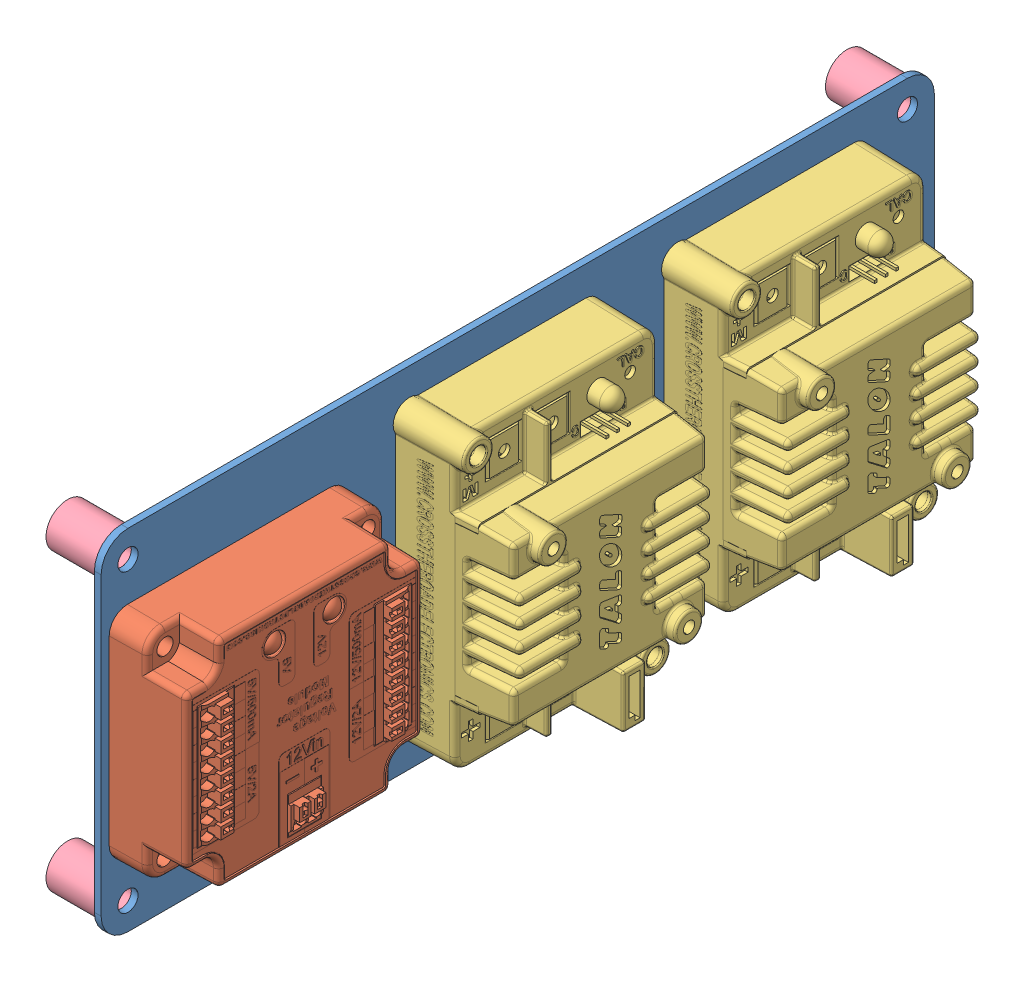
SolidWorks assembly PCM, VRM, Talon Mount.SLDASM, configuration Default (file format 8000). Lengths in mm.
Overall size (43.48 82.89 197.52).
8 component instances, 4 part files, 14 mates.
Components (placement in the parent):
- PCM, VRM, Talon mount-1: PCM, VRM, Talon mount.SLDPRT [Default] at (5.287 88.3995 196.8171) size (1.59 82.55 196.85)
- VRM-1: VRM.SLDPRT [Default] at (14.0059 49.0403 166.1841) x (0 0 -1) z (0 -1 0) size (56.39 19.92 51.56)
- Talon-1: Talon.SLDPRT [Default] at (44.8197 -14.9852 -14.6647) x (0 -1 0) z (0 0 1) size (69.75 29.27 49.43)
- Board Standoff-1: Board Standoff.SLDPRT [Default] at (5.287 82.0495 6.3171) x (0 0.018762 0.999824) z (0 -0.999824 0.018762) size (10.16 12.7 10.16)
- Board Standoff-2: Board Standoff.SLDPRT [Default] at (5.287 82.0495 190.4671) x (0 0.018762 0.999824) z (0 -0.999824 0.018762) size (10.16 12.7 10.16)
- Board Standoff-3: Board Standoff.SLDPRT [Default] at (-7.413 12.1995 190.4671) x (0 -0.916898 -0.399123) z (0 -0.399123 0.916898) size (10.16 12.7 10.16)
- Board Standoff-4: Board Standoff.SLDPRT [Default] at (-7.413 12.1995 6.3171) x (0 -0.916898 -0.399123) z (0 -0.399123 0.916898) size (10.16 12.7 10.16)
- Talon-2: Talon.SLDPRT [Default] at (44.8197 -15.0868 48.7337) x (0 -1 0) z (0 0 1) size (69.75 29.27 49.43)
Mates (geometry in assembly coordinates):
- Coincident4: coincident anti-aligned: plane of PCM, VRM, Talon mount-1 through (6.8745 88.3995 196.8171) normal (1 0 0); plane of VRM-1 through (6.8745 68.5875 142.8397) normal (-1 0 0)
- Concentric5: concentric anti-aligned: cylinder of PCM, VRM, Talon mount-1 through (5.287 68.7145 142.8421) axis (1 0 0) radius 2.3813; cylinder of VRM-1 through (24.9119 68.7145 142.8421) axis (-1 0 0) radius 1.905
- Perpendicular2: perpendicular: plane of PCM, VRM, Talon mount-1 through (6.8745 88.3995 196.8171) normal (0 1 0); plane of VRM-1 through (6.8745 68.5875 194.9097) normal (0.017452 0 0.999848)
- Coincident6: coincident anti-aligned: plane of PCM, VRM, Talon mount-1 through (6.8745 88.3995 196.8171) normal (1 0 0); plane of Talon-1 through (6.8745 78.2395 60.6096) normal (-1 0 0)
- Concentric6: concentric aligned: cylinder of PCM, VRM, Talon mount-1 through (5.287 78.2395 60.6096) axis (1 0 0) radius 2.3813; cylinder of Talon-1 through (4.3345 78.2395 60.6096) axis (1 0 0) radius 1.905
- Perpendicular3: perpendicular: plane of PCM, VRM, Talon mount-1 through (6.8745 88.3995 196.8171) normal (0 1 0); plane of Talon-1 through (6.8745 18.0553 15.5246) normal (0.017452 0 -0.999848)
- Concentric7: concentric anti-aligned: cylinder of PCM, VRM, Talon mount-1 through (6.8745 82.0495 6.3171) axis (-1 0 0) radius 2.3813; cylinder of Board Standoff-1 through (-7.413 82.0495 6.3171) axis (1 0 0) radius 2.3813
- Coincident8: coincident anti-aligned: plane of PCM, VRM, Talon mount-1 through (5.287 88.3995 196.8171) normal (-1 0 0); plane of Board Standoff-1 through (5.287 82.0495 6.3171) normal (1 0 0)
- Coincident10: coincident anti-aligned: circle of PCM, VRM, Talon mount-1; circle of Board Standoff-2
- Coincident11: coincident aligned: circle of PCM, VRM, Talon mount-1; circle of Board Standoff-3
- Coincident12: coincident aligned: circle of PCM, VRM, Talon mount-1; circle of Board Standoff-4
- Concentric10: concentric aligned: cylinder of PCM, VRM, Talon mount-1 through (5.287 16.0095 82.1996) axis (1 0 0) radius 2.3813; cylinder of Talon-2 through (4.3345 16.0095 82.1996) axis (1 0 0) radius 1.905
- Coincident13: coincident anti-aligned: plane of PCM, VRM, Talon mount-1 through (6.8745 88.3995 196.8171) normal (1 0 0); plane of Talon-2 through (6.8745 78.1379 124.008) normal (-1 0 0)
- Perpendicular4: perpendicular: plane of PCM, VRM, Talon mount-1 through (6.8745 5.8495 196.8171) normal (0 -1 0); plane of Talon-2 through (6.8745 12.7329 127.2846) normal (0.017452 0 0.999848)
